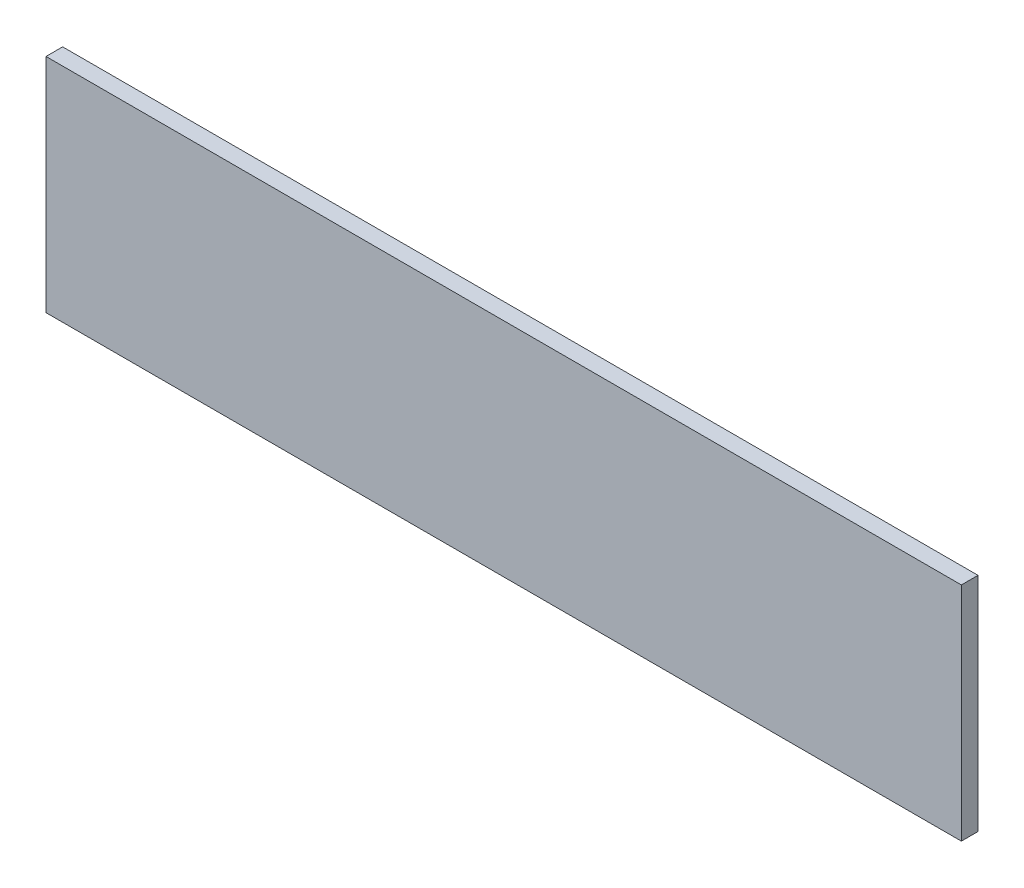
from build123d import *

# Parameters (mm, degrees)
SKETCH_1_W      = 165
SKETCH_1_H      = 40
EXTRUDE_1_DEPTH = 3


with BuildPart() as part:
    # Sketch 1 → Extrude 1 (new body)
    with BuildSketch(Plane.XY):
        Rectangle(SKETCH_1_W, SKETCH_1_H)
    extrude(amount=EXTRUDE_1_DEPTH)


solid = part.part
